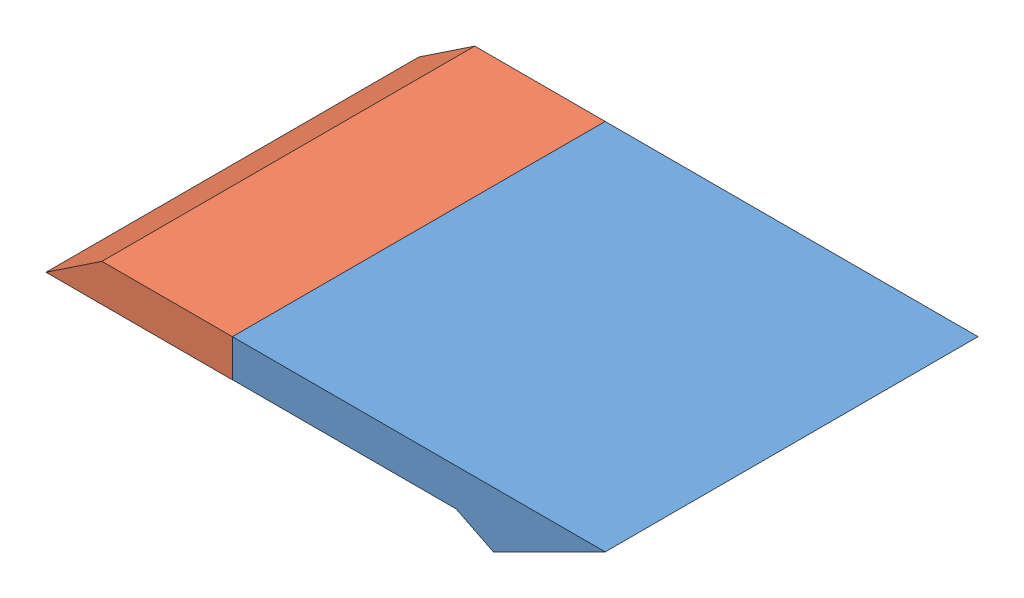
SolidWorks assembly attache.SLDASM, configuration Défaut (file format 9000). Lengths in mm.
Overall size (15 1.5 10).
2 component instances, 2 part files, 0 mates.
Components (placement in the parent):
- crochet-1: crochet.SLDPRT [Défaut] at (21.142 -0.3086 5) size (10 1.5 10)
- crochet2-1: crochet2.SLDPRT [Défaut] at (22.2966 -0.3122 5) size (5 1 10)
